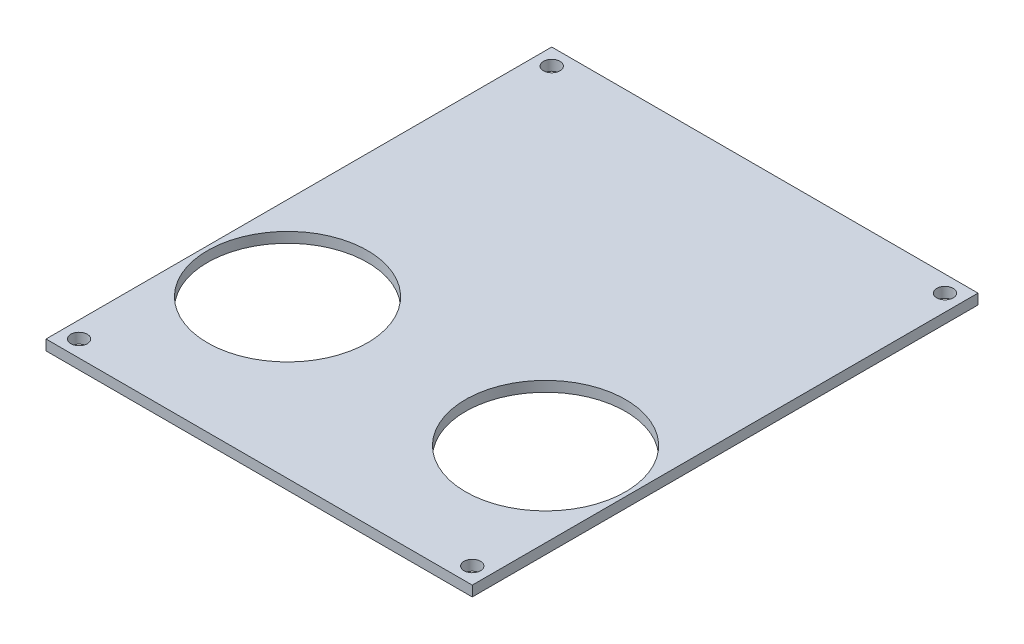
from build123d import *

# Parameters (mm, degrees)
SKETCH1_W                  = 82.6
SKETCH1_H                  = 98
BOSS_EXTRUDE1_DEPTH        = 2
F_3_2_3_2_DIAMETER_HOLE1_D = 3.2
SKETCH4_R                  = 15.5
CUT_EXTRUDE1_DEPTH         = 2


with BuildPart() as part:
    # Sketch1 → Boss-Extrude1 (new body)
    with BuildSketch(Plane(origin=(0, 0, 0), x_dir=(1, 0, 0), z_dir=(0, 1, 0))):
        Rectangle(SKETCH1_W, SKETCH1_H)
    extrude(amount=BOSS_EXTRUDE1_DEPTH)

    # 3.2 _3.2_ Diameter Hole1 (through all)
    with Locations(Plane(origin=(0, 2, 0), x_dir=(1, 0, 0), z_dir=(0, 1, 0))):
        with Locations((-38.1, 45.8), (38.1, 45.8), (38.1, -45.8), (-38.1, -45.8)):
            Hole(F_3_2_3_2_DIAMETER_HOLE1_D / 2)

    # Sketch4 → Cut-Extrude1 (cut)
    with BuildSketch(Plane(origin=(0, 2, 0), x_dir=(1, 0, 0), z_dir=(0, 1, 0))):
        with Locations(Location((-25, -18.5, 0), (0, 0, 270))):
            Circle(SKETCH4_R)
        with Locations(Location((25, -18.5, 0), (0, 0, 270))):
            Circle(SKETCH4_R)
    extrude(amount=-CUT_EXTRUDE1_DEPTH, mode=Mode.SUBTRACT)


solid = part.part
